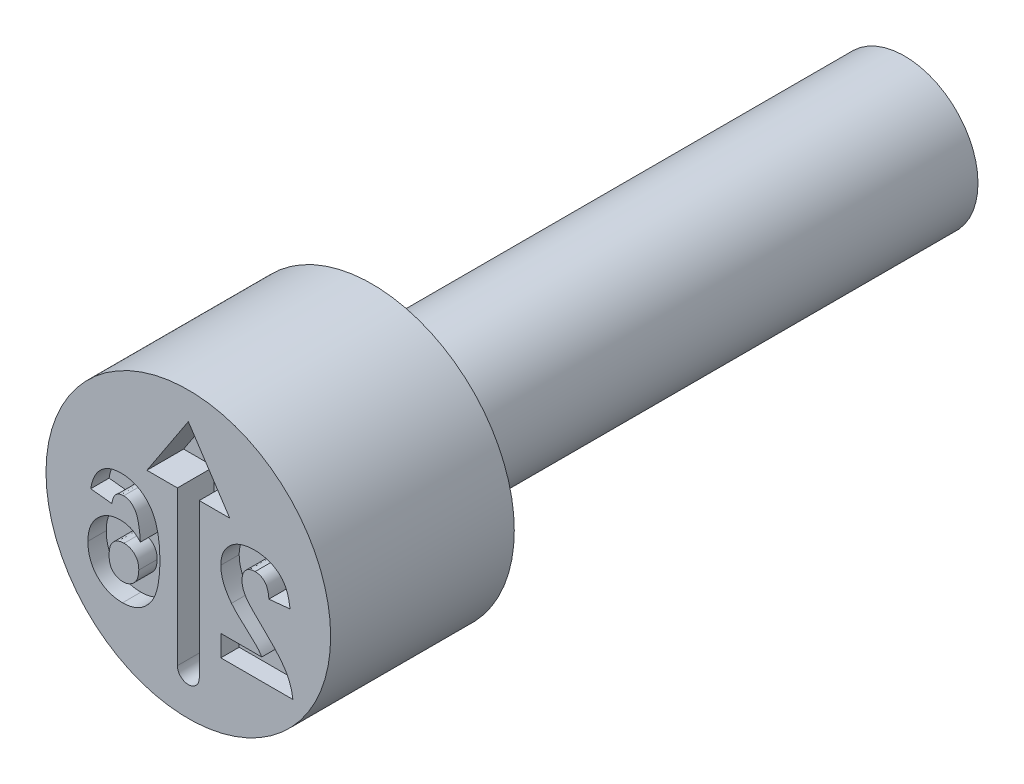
from build123d import *

# Parameters (mm, degrees)
CUT_EXTRUDE4_DEPTH = 0.4
CUT_EXTRUDE5_DEPTH = 0.2


with BuildPart() as part:
    # Sketch2 → Revolve1 (revolve)
    with BuildSketch(Plane(origin=(0, 0, 0), x_dir=(0, 0, -1), z_dir=(1, 0, 0)), mode=Mode.PRIVATE) as revolve1_sk:
        Polygon((0, 1.55), (0, 0), (7.8, 0), (7.8, 0.8), (2, 0.8), (2, 1.55), align=None)
    revolve(revolve1_sk.sketch.rotate(Axis((0, 0, -0.403888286), (0, 0, -1)), 90), axis=Axis((0, 0, -0.403888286), (0, 0, -1)))

    # Sketch3 → Cut-Extrude4 (cut)
    with BuildSketch(Plane.XY):
        with BuildLine():
            Line((0.119045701, 0.566469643), (0.119045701, -1.110101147))
            ThreePointArc((0.119045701, -1.110101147), (0, -1.229146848), (-0.119045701, -1.110101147))
            Line((-0.119045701, -1.110101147), (-0.119045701, 0.566469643))
            Line((-0.119045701, 0.566469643), (-0.451198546, 0.566469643))
            Line((-0.451198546, 0.566469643), (0, 1.251322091))
            Line((0, 1.251322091), (0.451198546, 0.566469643))
            Line((0.451198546, 0.566469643), (0.119045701, 0.566469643))
        make_face()
    extrude(amount=-CUT_EXTRUDE4_DEPTH, mode=Mode.SUBTRACT)

    # Sketch4 → Cut-Extrude5 (cut)
    # profile 1 of 2: a face of its own
    with BuildSketch(Plane.XY):
        with BuildLine():
            Line((0.353846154, -0.569230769), (0.353846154, -0.8))
            Line((0.353846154, -0.8), (1.138461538, -0.8))
            add(Edge.make_bspline(
                [(1.138461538, -0.8), (1.135805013, -0.780277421), (1.13049345, -0.740843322), (1.114071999, -0.683240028), (1.092154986, -0.627029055), (1.068368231, -0.581286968), (1.044709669, -0.544466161), (1.023244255, -0.514294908), (0.997636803, -0.482193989), (0.968258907, -0.447904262), (0.935272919, -0.411318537), (0.898432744, -0.372572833), (0.857562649, -0.331852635), (0.828809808, -0.304201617), (0.813942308, -0.289903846)],
                knots=[0, 0, 0, 0, 1.156289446, 2.311930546, 3.473459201, 4.661751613, 5.303057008, 6.018253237, 6.81459331, 7.690699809, 8.644447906, 9.679642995, 10.800191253, 12, 12, 12, 12], degree=3))
            add(Edge.make_bspline(
                [(0.813942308, -0.289903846), (0.802077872, -0.278451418), (0.779491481, -0.256649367), (0.747328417, -0.225429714), (0.719053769, -0.196729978), (0.694076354, -0.171293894), (0.672973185, -0.148473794), (0.65546667, -0.128628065), (0.641335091, -0.111675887), (0.633681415, -0.100921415), (0.630288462, -0.096153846)],
                knots=[0, 0, 0, 0, 1.480720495, 2.818855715, 4.024636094, 5.098235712, 6.019786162, 6.815086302, 7.474715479, 8, 8, 8, 8], degree=3))
            add(Edge.make_bspline(
                [(0.630288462, -0.096153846), (0.623340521, -0.084612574), (0.609938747, -0.062350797), (0.595242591, -0.02734375), (0.58642141, 0.007656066), (0.585210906, 0.031042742), (0.584615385, 0.042548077)],
                knots=[0, 0, 0, 0, 1.0911822, 2.104764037, 3.067617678, 4, 4, 4, 4], degree=3))
            add(Edge.make_bspline(
                [(0.584615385, 0.042548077), (0.585047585, 0.054520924), (0.585865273, 0.077172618), (0.592721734, 0.109138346), (0.604880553, 0.136617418), (0.621621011, 0.159694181), (0.642789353, 0.177774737), (0.66753576, 0.191134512), (0.69622248, 0.198520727), (0.716385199, 0.199492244), (0.726923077, 0.2)],
                knots=[0, 0, 0, 0, 1.193122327, 2.257294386, 3.237245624, 4.168877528, 5.075331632, 5.990371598, 6.949684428, 8, 8, 8, 8], degree=3))
            add(Edge.make_bspline(
                [(0.726923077, 0.2), (0.737389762, 0.199525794), (0.757609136, 0.198609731), (0.786345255, 0.190607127), (0.811484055, 0.176753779), (0.829399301, 0.160966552), (0.8415019, 0.14561462), (0.849748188, 0.132236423), (0.856855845, 0.117034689), (0.863153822, 0.100180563), (0.868128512, 0.081480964), (0.872134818, 0.061078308), (0.875363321, 0.0388628), (0.876390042, 0.023408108), (0.876923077, 0.015384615)],
                knots=[0, 0, 0, 0, 1.402788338, 2.709884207, 3.961032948, 5.225417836, 5.883680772, 6.578928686, 7.329201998, 8.132101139, 8.990263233, 9.922304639, 10.921339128, 12, 12, 12, 12], degree=3))
            Line((0.876923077, 0.015384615), (1.107692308, 0.037980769))
            add(Edge.make_bspline(
                [(1.107692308, 0.037980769), (1.105836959, 0.053560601), (1.102239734, 0.083767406), (1.093262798, 0.127154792), (1.081893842, 0.167181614), (1.067590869, 0.20377359), (1.050945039, 0.237163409), (1.031107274, 0.266850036), (1.008770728, 0.293162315), (0.983916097, 0.316086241), (0.95670139, 0.335694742), (0.928144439, 0.353198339), (0.897687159, 0.367556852), (0.865664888, 0.379390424), (0.832092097, 0.38884772), (0.796813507, 0.395100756), (0.760046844, 0.399499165), (0.734949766, 0.399830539), (0.722115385, 0.4)],
                knots=[0, 0, 0, 0, 1.270971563, 2.464210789, 3.586263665, 4.638946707, 5.643716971, 6.603612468, 7.52484387, 8.434700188, 9.336036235, 10.239171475, 11.145359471, 12.059630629, 13.003312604, 13.96741569, 14.960557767, 16, 16, 16, 16], degree=3))
            add(Edge.make_bspline(
                [(0.722115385, 0.4), (0.708162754, 0.399731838), (0.680988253, 0.399209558), (0.641318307, 0.394896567), (0.604051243, 0.387376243), (0.568861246, 0.37741451), (0.536109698, 0.364114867), (0.505523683, 0.348036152), (0.47758457, 0.328568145), (0.451875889, 0.30677252), (0.428894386, 0.282804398), (0.408764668, 0.257238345), (0.391900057, 0.230092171), (0.377748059, 0.201696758), (0.367240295, 0.171595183), (0.359583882, 0.140203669), (0.354507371, 0.107375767), (0.354068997, 0.084955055), (0.353846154, 0.073557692)],
                knots=[0, 0, 0, 0, 1.210756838, 2.35810096, 3.457354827, 4.507168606, 5.527358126, 6.519769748, 7.499700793, 8.476517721, 9.440526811, 10.376769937, 11.295256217, 12.209626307, 13.124630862, 14.055668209, 15.011616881, 16, 16, 16, 16], degree=3))
            add(Edge.make_bspline(
                [(0.353846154, 0.073557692), (0.354139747, 0.060477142), (0.354722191, 0.034527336), (0.36029866, -0.003834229), (0.368818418, -0.041311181), (0.38140995, -0.07799511), (0.397370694, -0.114765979), (0.417944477, -0.151706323), (0.441832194, -0.189930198), (0.460535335, -0.214643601), (0.470192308, -0.227403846)],
                knots=[0, 0, 0, 0, 0.953409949, 1.89141903, 2.821310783, 3.752688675, 4.715703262, 5.740811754, 6.833515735, 8, 8, 8, 8], degree=3))
            add(Edge.make_bspline(
                [(0.470192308, -0.227403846), (0.473842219, -0.232000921), (0.481659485, -0.241846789), (0.494958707, -0.256943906), (0.510371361, -0.273434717), (0.527679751, -0.291627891), (0.547455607, -0.310879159), (0.568987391, -0.331993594), (0.593222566, -0.353891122), (0.618324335, -0.377117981), (0.643535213, -0.399724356), (0.666707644, -0.4211954), (0.687755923, -0.440192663), (0.70569979, -0.45776488), (0.7215947, -0.472712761), (0.734867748, -0.485802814), (0.745767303, -0.496718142), (0.760786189, -0.513732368), (0.779896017, -0.536744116), (0.793340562, -0.558732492), (0.799759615, -0.569230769)],
                knots=[0, 0, 0, 0, 0.665555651, 1.425465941, 2.280616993, 3.225313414, 4.272635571, 5.410053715, 6.644756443, 7.976022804, 9.288331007, 10.484517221, 11.558462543, 12.503158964, 13.33222979, 14.032602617, 14.617328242, 15.080653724, 16.606167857, 18, 18, 18, 18], degree=3))
            Line((0.799759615, -0.569230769), (0.353846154, -0.569230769))
        make_face()
    # profile 2 of 2: a face of its own
    with BuildSketch(Plane.XY):
        with BuildLine():
            Line((-1.062769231, 0.086778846), (-0.832, 0.061538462))
            add(Edge.make_bspline(
                [(-0.832, 0.061538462), (-0.830453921, 0.072653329), (-0.827544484, 0.093569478), (-0.818926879, 0.122433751), (-0.806930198, 0.146715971), (-0.791531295, 0.16645009), (-0.773189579, 0.181638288), (-0.752290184, 0.192430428), (-0.728846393, 0.198836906), (-0.712409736, 0.199602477), (-0.703875, 0.2)],
                knots=[0, 0, 0, 0, 1.280716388, 2.410074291, 3.425374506, 4.35753932, 5.248331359, 6.12451615, 7.026154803, 8, 8, 8, 8], degree=3))
            add(Edge.make_bspline(
                [(-0.703875, 0.2), (-0.698087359, 0.19985848), (-0.686570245, 0.199576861), (-0.66979417, 0.196001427), (-0.653620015, 0.19069546), (-0.638179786, 0.183180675), (-0.623396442, 0.17348424), (-0.609494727, 0.161490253), (-0.595835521, 0.147830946), (-0.583222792, 0.131336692), (-0.571122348, 0.111806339), (-0.560703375, 0.087897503), (-0.551416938, 0.059632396), (-0.543465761, 0.026872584), (-0.536250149, -0.010173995), (-0.530335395, -0.05165731), (-0.525602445, -0.097614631), (-0.523331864, -0.129799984), (-0.522144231, -0.146634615)],
                knots=[0, 0, 0, 0, 0.642458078, 1.278459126, 1.898279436, 2.531842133, 3.181731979, 3.858193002, 4.57010051, 5.325711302, 6.161524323, 7.118599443, 8.217371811, 9.466325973, 10.864147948, 12.412648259, 14.123626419, 16, 16, 16, 16], degree=3))
            add(Edge.make_bspline(
                [(-0.522144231, -0.146634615), (-0.529519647, -0.138623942), (-0.543982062, -0.122915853), (-0.567979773, -0.102436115), (-0.593120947, -0.084927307), (-0.619679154, -0.07056288), (-0.647799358, -0.05987329), (-0.676972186, -0.05175689), (-0.70757951, -0.047210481), (-0.728380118, -0.046510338), (-0.738971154, -0.046153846)],
                knots=[0, 0, 0, 0, 1.057745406, 2.074127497, 3.059409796, 4.031705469, 5.000875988, 5.977809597, 6.970362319, 8, 8, 8, 8], degree=3))
            add(Edge.make_bspline(
                [(-0.738971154, -0.046153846), (-0.75092402, -0.046498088), (-0.774526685, -0.047177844), (-0.80929889, -0.05194551), (-0.842665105, -0.06051863), (-0.874776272, -0.072115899), (-0.905791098, -0.086719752), (-0.935116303, -0.105206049), (-0.963212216, -0.126760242), (-0.989692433, -0.151385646), (-1.014021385, -0.178496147), (-1.035501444, -0.207777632), (-1.053178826, -0.239319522), (-1.068290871, -0.272415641), (-1.079534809, -0.307719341), (-1.087696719, -0.344722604), (-1.092568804, -0.38376509), (-1.093210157, -0.410402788), (-1.093538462, -0.424038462)],
                knots=[0, 0, 0, 0, 0.99135015, 1.957564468, 2.903754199, 3.843479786, 4.78583385, 5.741106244, 6.712813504, 7.719198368, 8.735844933, 9.730198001, 10.724351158, 11.729813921, 12.742848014, 13.790983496, 14.86921809, 16, 16, 16, 16], degree=3))
            add(Edge.make_bspline(
                [(-1.093538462, -0.424038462), (-1.093205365, -0.438473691), (-1.092555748, -0.466625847), (-1.087774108, -0.507855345), (-1.079327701, -0.54677135), (-1.067788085, -0.583686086), (-1.052861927, -0.618307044), (-1.034780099, -0.650919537), (-1.012930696, -0.680966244), (-0.988305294, -0.708851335), (-0.960852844, -0.73373517), (-0.931596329, -0.755770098), (-0.90021125, -0.774087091), (-0.867161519, -0.789503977), (-0.831879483, -0.800817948), (-0.794987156, -0.809302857), (-0.756184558, -0.814477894), (-0.729692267, -0.815077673), (-0.716134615, -0.815384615)],
                knots=[0, 0, 0, 0, 1.13287417, 2.209376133, 3.25169942, 4.254157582, 5.240146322, 6.205890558, 7.174579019, 8.150183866, 9.1206468, 10.07783463, 11.019441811, 11.967766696, 12.934309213, 13.921380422, 14.936249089, 16, 16, 16, 16], degree=3))
            add(Edge.make_bspline(
                [(-0.716134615, -0.815384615), (-0.701607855, -0.814978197), (-0.673045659, -0.814179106), (-0.631233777, -0.807602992), (-0.591482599, -0.796477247), (-0.553797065, -0.78093967), (-0.517863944, -0.761395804), (-0.484016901, -0.737118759), (-0.45234563, -0.708340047), (-0.422431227, -0.675449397), (-0.395209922, -0.637458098), (-0.372028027, -0.593548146), (-0.352367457, -0.544200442), (-0.336360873, -0.489288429), (-0.324004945, -0.428816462), (-0.315383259, -0.36277947), (-0.309656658, -0.291286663), (-0.309173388, -0.241758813), (-0.308923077, -0.216105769)],
                knots=[0, 0, 0, 0, 0.852151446, 1.675481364, 2.476404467, 3.269281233, 4.062617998, 4.871616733, 5.707301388, 6.56955125, 7.476395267, 8.442009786, 9.475854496, 10.58877921, 11.794095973, 13.094195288, 14.494932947, 16, 16, 16, 16], degree=3))
            add(Edge.make_bspline(
                [(-0.308923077, -0.216105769), (-0.309281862, -0.189813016), (-0.309975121, -0.139009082), (-0.315553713, -0.065655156), (-0.324414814, 0.002084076), (-0.337323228, 0.06405586), (-0.353834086, 0.120388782), (-0.373850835, 0.171196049), (-0.397876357, 0.216293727), (-0.425809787, 0.255535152), (-0.456544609, 0.289646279), (-0.48956931, 0.319089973), (-0.524757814, 0.344150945), (-0.562109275, 0.364765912), (-0.60193032, 0.380394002), (-0.643843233, 0.391679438), (-0.687918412, 0.398932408), (-0.718109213, 0.39964042), (-0.733442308, 0.4)],
                knots=[0, 0, 0, 0, 1.491699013, 2.882321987, 4.171520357, 5.365488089, 6.470299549, 7.49861535, 8.458736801, 9.361983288, 10.224742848, 11.058789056, 11.867429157, 12.671146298, 13.473202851, 14.288259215, 15.130652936, 16, 16, 16, 16], degree=3))
            add(Edge.make_bspline(
                [(-0.733442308, 0.4), (-0.744272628, 0.399805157), (-0.765444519, 0.399424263), (-0.796474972, 0.395379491), (-0.826077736, 0.389194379), (-0.854330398, 0.380632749), (-0.88103404, 0.369167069), (-0.9062947, 0.355199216), (-0.930197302, 0.33876702), (-0.952617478, 0.319976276), (-0.973374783, 0.298770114), (-0.992118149, 0.275100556), (-1.008971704, 0.249253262), (-1.024009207, 0.221249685), (-1.036622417, 0.190821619), (-1.047465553, 0.158208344), (-1.056383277, 0.123339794), (-1.060608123, 0.099151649), (-1.062769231, 0.086778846)],
                knots=[0, 0, 0, 0, 1.036027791, 2.025301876, 2.989435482, 3.928225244, 4.845595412, 5.765526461, 6.686607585, 7.61747015, 8.561102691, 9.521661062, 10.50224679, 11.510949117, 12.559251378, 13.650572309, 14.798212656, 16, 16, 16, 16], degree=3))
        make_face()
        with BuildLine():
            add(Edge.make_bspline(
                [(-0.539692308, -0.41875), (-0.539779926, -0.42637143), (-0.539951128, -0.441263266), (-0.542758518, -0.462872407), (-0.546793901, -0.483130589), (-0.552229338, -0.502150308), (-0.559763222, -0.51964371), (-0.568701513, -0.535961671), (-0.579274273, -0.550956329), (-0.595496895, -0.568549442), (-0.617913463, -0.587027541), (-0.64733192, -0.603482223), (-0.678853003, -0.613710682), (-0.700595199, -0.614823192), (-0.711567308, -0.615384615)],
                knots=[0, 0, 0, 0, 0.93816693, 1.833124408, 2.679057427, 3.481731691, 4.264557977, 5.020023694, 5.770442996, 6.518065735, 7.962605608, 9.32780964, 10.651490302, 12, 12, 12, 12], degree=3))
            add(Edge.make_bspline(
                [(-0.711567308, -0.615384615), (-0.721961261, -0.614918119), (-0.742191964, -0.614010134), (-0.771081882, -0.605711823), (-0.797324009, -0.592624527), (-0.816561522, -0.577259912), (-0.829975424, -0.562315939), (-0.838989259, -0.549210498), (-0.84632653, -0.534260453), (-0.852325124, -0.517712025), (-0.857156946, -0.499629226), (-0.860455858, -0.479830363), (-0.862327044, -0.458369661), (-0.862618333, -0.443513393), (-0.862769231, -0.435817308)],
                knots=[0, 0, 0, 0, 1.399678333, 2.724321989, 4.020062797, 5.33532049, 6.016755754, 6.724441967, 7.473839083, 8.257094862, 9.096253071, 9.995581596, 10.961638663, 12, 12, 12, 12], degree=3))
            add(Edge.make_bspline(
                [(-0.862769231, -0.435817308), (-0.862640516, -0.427879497), (-0.862391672, -0.412533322), (-0.860214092, -0.390352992), (-0.856651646, -0.369848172), (-0.851671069, -0.350873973), (-0.844929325, -0.333684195), (-0.836975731, -0.31793212), (-0.827319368, -0.304044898), (-0.812968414, -0.287711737), (-0.792101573, -0.271253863), (-0.76421954, -0.256263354), (-0.73296674, -0.247765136), (-0.711216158, -0.246701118), (-0.700028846, -0.246153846)],
                knots=[0, 0, 0, 0, 1.008384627, 1.949510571, 2.828269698, 3.650667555, 4.437180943, 5.170285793, 5.887596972, 6.580056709, 7.926803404, 9.238379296, 10.579573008, 12, 12, 12, 12], degree=3))
            add(Edge.make_bspline(
                [(-0.700028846, -0.246153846), (-0.689151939, -0.246596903), (-0.668027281, -0.24745739), (-0.637668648, -0.256098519), (-0.609890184, -0.269848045), (-0.589429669, -0.286000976), (-0.575008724, -0.301224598), (-0.565563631, -0.314186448), (-0.55734214, -0.328298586), (-0.550849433, -0.343925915), (-0.545843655, -0.360775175), (-0.542253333, -0.378961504), (-0.540080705, -0.398424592), (-0.539824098, -0.411853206), (-0.539692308, -0.41875)],
                knots=[0, 0, 0, 0, 1.469034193, 2.853094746, 4.235454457, 5.641396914, 6.354997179, 7.06867986, 7.807229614, 8.560602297, 9.353235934, 10.182779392, 11.06669468, 12, 12, 12, 12], degree=3))
        make_face(mode=Mode.SUBTRACT)
    extrude(amount=-CUT_EXTRUDE5_DEPTH, mode=Mode.SUBTRACT)


solid = part.part
